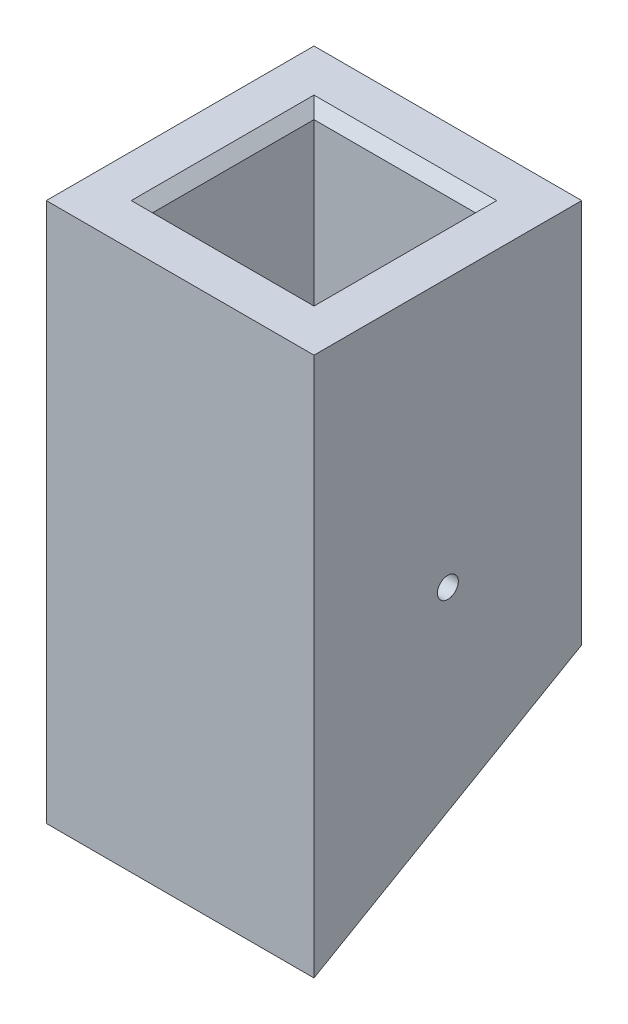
from build123d import *

# Parameters (mm, degrees)
SKETCH1_W               = 32.004
SKETCH1_H               = 32.004
SKETCH1_W_2             = 19.304
SKETCH1_H_2             = 19.304
BOSS_EXTRUDE1_DEPTH     = 57.15
CUT_EXTRUDE1_DEPTH      = 68.427312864
CUT_EXTRUDE1_DEPTH_BACK = 57.15
SKETCH3_R               = 1.25
CUT_EXTRUDE2_DEPTH      = 57.15
BOSS_EXTRUDE3_DEPTH     = 32.004
CHAMFER1_SIZE           = 1.27


with BuildPart() as part:
    # Sketch1 → Boss-Extrude1 (new body)
    with BuildSketch(Plane(origin=(0, 0, 0), x_dir=(1, 0, 0), z_dir=(0, 1, 0))):
        Rectangle(SKETCH1_W, SKETCH1_H)
        Rectangle(SKETCH1_W_2, SKETCH1_H_2, mode=Mode.SUBTRACT)
    extrude(amount=BOSS_EXTRUDE1_DEPTH)

    # Sketch2 → Cut-Extrude1 (cut, two sides: drawn at the far end of the back side and taken through both)
    with BuildSketch(Plane(origin=(16.002, 0, 0), x_dir=(0, 0, -1), z_dir=(1, 0, 0)).offset(-CUT_EXTRUDE1_DEPTH_BACK)):
        Polygon((16.002, 18.477518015), (-16.002, 0), (16.002, 0), align=None)
    extrude(amount=CUT_EXTRUDE1_DEPTH + CUT_EXTRUDE1_DEPTH_BACK, mode=Mode.SUBTRACT)

    # Sketch3 → Cut-Extrude2 (cut)
    with BuildSketch(Plane(origin=(16.002, 0, 0), x_dir=(0, 0, -1), z_dir=(1, 0, 0))):
        with Locations((0, 25.113759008)):
            Circle(SKETCH3_R)
    extrude(amount=-CUT_EXTRUDE2_DEPTH, mode=Mode.SUBTRACT)

    # Sketch5 → Boss-Extrude3 (add)
    with BuildSketch(Plane(origin=(16.002, 0, 0), x_dir=(0, 0, -1), z_dir=(1, 0, 0))):
        Polygon((-16.002, -7.332348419), (16.002, 11.145169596), (16.002, 18.477518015), (-16.002, 0), align=None)
    extrude(amount=-BOSS_EXTRUDE3_DEPTH)

    # Chamfer1
    chamfer1_edges = [part.edges().sort_by_distance(p)[0] for p in [
        (0, 57.15, -9.652),
        (9.652, 57.15, 0),
        (0, 57.15, 9.652),
        (-9.652, 57.15, 0),
    ]]
    chamfer(chamfer1_edges, length=CHAMFER1_SIZE)


solid = part.part
